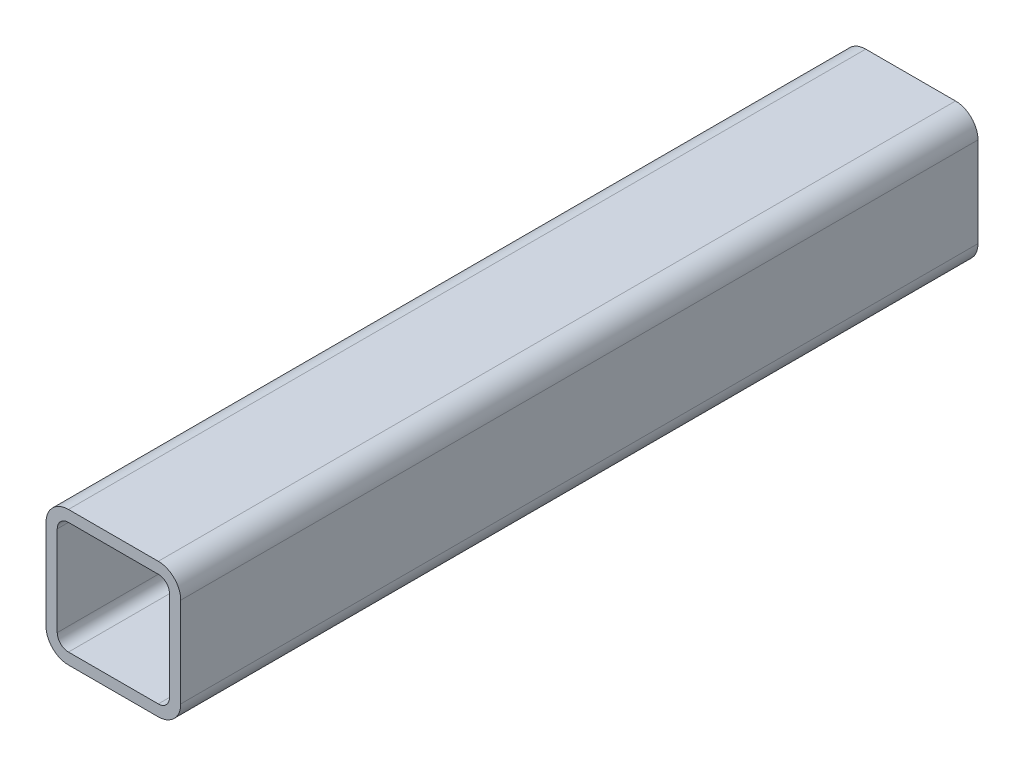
from build123d import *

# Parameters (mm, degrees)
BASE_EXTRUDE_THIN_DEPTH = 450.85


with BuildPart() as part:
    # Sketch1 → Base-Extrude-Thin (new body)
    with BuildSketch(Plane.XY):
        with BuildLine():
            Line((38.1, 25.4), (38.1, -25.4))
            ThreePointArc((38.1, -25.4), (34.380256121, -34.380256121), (25.4, -38.1))
            Line((25.4, -38.1), (-25.4, -38.1))
            ThreePointArc((-25.4, -38.1), (-34.380256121, -34.380256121), (-38.1, -25.4))
            Line((-38.1, -25.4), (-38.1, 25.4))
            ThreePointArc((-38.1, 25.4), (-34.380256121, 34.380256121), (-25.4, 38.1))
            Line((-25.4, 38.1), (25.4, 38.1))
            ThreePointArc((25.4, 38.1), (34.380256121, 34.380256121), (38.1, 25.4))
        make_face()
        with BuildLine():
            Line((31.75, 25.4), (31.75, -25.4))
            ThreePointArc((31.75, -25.4), (29.890128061, -29.890128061), (25.4, -31.75))
            Line((25.4, -31.75), (-25.4, -31.75))
            ThreePointArc((-25.4, -31.75), (-29.890128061, -29.890128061), (-31.75, -25.4))
            Line((-31.75, -25.4), (-31.75, 25.4))
            ThreePointArc((-31.75, 25.4), (-29.890128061, 29.890128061), (-25.4, 31.75))
            Line((-25.4, 31.75), (25.4, 31.75))
            ThreePointArc((25.4, 31.75), (29.890128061, 29.890128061), (31.75, 25.4))
        make_face(mode=Mode.SUBTRACT)
    extrude(amount=BASE_EXTRUDE_THIN_DEPTH)


solid = part.part
